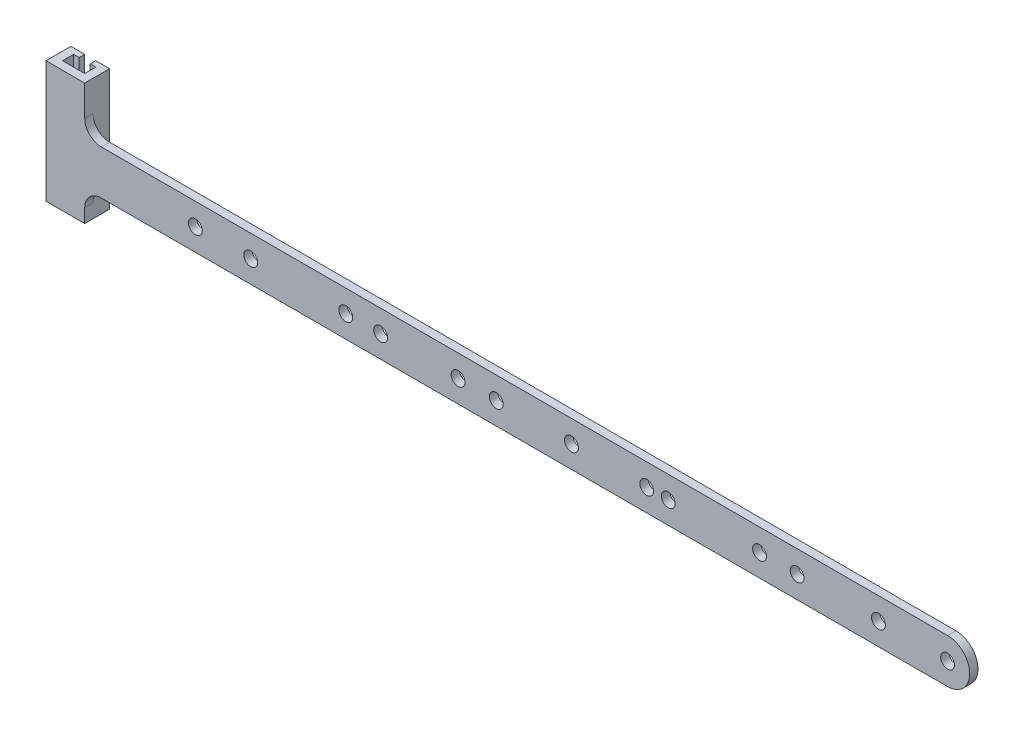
ISO-10303-21;
HEADER;
FILE_DESCRIPTION(('STEP AP214'),'2;1');
FILE_NAME('part.step','',(''),(''),'','','');
FILE_SCHEMA(('AUTOMOTIVE_DESIGN { 1 0 10303 214 1 1 1 1 }'));
ENDSEC;
DATA;
#1=APPLICATION_CONTEXT('core data for automotive mechanical design processes');
#2=APPLICATION_PROTOCOL_DEFINITION('international standard','automotive_design',2000,#1);
#3=PRODUCT_CONTEXT('',#1,'mechanical');
#4=PRODUCT('Part','Part','',(#3));
#5=PRODUCT_RELATED_PRODUCT_CATEGORY('part','',(#4));
#6=PRODUCT_DEFINITION_FORMATION('','',#4);
#7=PRODUCT_DEFINITION_CONTEXT('part definition',#1,'design');
#8=PRODUCT_DEFINITION('design','',#6,#7);
#9=PRODUCT_DEFINITION_SHAPE('','',#8);
#10=(LENGTH_UNIT() NAMED_UNIT(*) SI_UNIT(.MILLI.,.METRE.));
#11=(NAMED_UNIT(*) PLANE_ANGLE_UNIT() SI_UNIT($,.RADIAN.));
#12=(NAMED_UNIT(*) SI_UNIT($,.STERADIAN.) SOLID_ANGLE_UNIT());
#13=UNCERTAINTY_MEASURE_WITH_UNIT(LENGTH_MEASURE(1.E-05),#10,'distance_accuracy_value','');
#14=(GEOMETRIC_REPRESENTATION_CONTEXT(3) GLOBAL_UNCERTAINTY_ASSIGNED_CONTEXT((#13)) GLOBAL_UNIT_ASSIGNED_CONTEXT((#10,
#11,#12)) REPRESENTATION_CONTEXT('',''));
#15=CARTESIAN_POINT('',(0.,0.,0.));
#16=DIRECTION('',(0.,0.,1.));
#17=DIRECTION('',(1.,0.,0.));
#18=AXIS2_PLACEMENT_3D('',#15,#16,#17);
#19=CARTESIAN_POINT('',(-11.6861635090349,-30.1146991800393,0.));
#20=DIRECTION('',(0.,0.,-1.));
#21=DIRECTION('',(-1.,0.,0.));
#22=AXIS2_PLACEMENT_3D('',#19,#20,#21);
#23=PLANE('',#22);
#24=CARTESIAN_POINT('',(269.313836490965,-44.1146991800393,0.));
#25=DIRECTION('',(0.,0.,-1.));
#26=DIRECTION('',(-1.,0.,0.));
#27=AXIS2_PLACEMENT_3D('',#24,#25,#26);
#28=CIRCLE('',#27,2.50000000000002);
#29=CARTESIAN_POINT('',(266.813836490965,-44.1146991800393,0.));
#30=VERTEX_POINT('',#29);
#31=EDGE_CURVE('E591',#30,#30,#28,.T.);
#32=ORIENTED_EDGE('',*,*,#31,.F.);
#33=EDGE_LOOP('',(#32));
#34=FACE_BOUND('',#33,.T.);
#35=CARTESIAN_POINT('',(185.513836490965,-44.1146991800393,0.));
#36=DIRECTION('',(0.,0.,-1.));
#37=DIRECTION('',(-1.,0.,0.));
#38=AXIS2_PLACEMENT_3D('',#35,#36,#37);
#39=CIRCLE('',#38,2.5);
#40=CARTESIAN_POINT('',(183.013836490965,-44.1146991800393,0.));
#41=VERTEX_POINT('',#40);
#42=EDGE_CURVE('E601',#41,#41,#39,.T.);
#43=ORIENTED_EDGE('',*,*,#42,.F.);
#44=EDGE_LOOP('',(#43));
#45=FACE_BOUND('',#44,.T.);
#46=CARTESIAN_POINT('',(294.313836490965,-44.1146991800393,0.));
#47=DIRECTION('',(0.,0.,-1.));
#48=DIRECTION('',(-1.,0.,0.));
#49=AXIS2_PLACEMENT_3D('',#46,#47,#48);
#50=CIRCLE('',#49,2.50000000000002);
#51=CARTESIAN_POINT('',(291.813836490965,-44.1146991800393,0.));
#52=VERTEX_POINT('',#51);
#53=EDGE_CURVE('E607',#52,#52,#50,.T.);
#54=ORIENTED_EDGE('',*,*,#53,.F.);
#55=EDGE_LOOP('',(#54));
#56=FACE_BOUND('',#55,.T.);
#57=CARTESIAN_POINT('',(89.3138364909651,-44.1146991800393,0.));
#58=DIRECTION('',(0.,0.,-1.));
#59=DIRECTION('',(-1.,0.,0.));
#60=AXIS2_PLACEMENT_3D('',#57,#58,#59);
#61=CIRCLE('',#60,2.5);
#62=CARTESIAN_POINT('',(86.8138364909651,-44.1146991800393,0.));
#63=VERTEX_POINT('',#62);
#64=EDGE_CURVE('E613',#63,#63,#61,.T.);
#65=ORIENTED_EDGE('',*,*,#64,.F.);
#66=EDGE_LOOP('',(#65));
#67=FACE_BOUND('',#66,.T.);
#68=CARTESIAN_POINT('',(158.313836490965,-44.1146991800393,0.));
#69=DIRECTION('',(0.,0.,-1.));
#70=DIRECTION('',(-1.,0.,0.));
#71=AXIS2_PLACEMENT_3D('',#68,#69,#70);
#72=CIRCLE('',#71,2.5);
#73=CARTESIAN_POINT('',(155.813836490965,-44.1146991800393,0.));
#74=VERTEX_POINT('',#73);
#75=EDGE_CURVE('E619',#74,#74,#72,.T.);
#76=ORIENTED_EDGE('',*,*,#75,.F.);
#77=EDGE_LOOP('',(#76));
#78=FACE_BOUND('',#77,.T.);
#79=CARTESIAN_POINT('',(117.313836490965,-44.1146991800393,0.));
#80=DIRECTION('',(0.,0.,-1.));
#81=DIRECTION('',(-1.,0.,0.));
#82=AXIS2_PLACEMENT_3D('',#79,#80,#81);
#83=CIRCLE('',#82,2.5);
#84=CARTESIAN_POINT('',(114.813836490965,-44.1146991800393,0.));
#85=VERTEX_POINT('',#84);
#86=EDGE_CURVE('E625',#85,#85,#83,.T.);
#87=ORIENTED_EDGE('',*,*,#86,.F.);
#88=EDGE_LOOP('',(#87));
#89=FACE_BOUND('',#88,.T.);
#90=CARTESIAN_POINT('',(239.913836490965,-44.1146991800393,0.));
#91=DIRECTION('',(0.,0.,-1.));
#92=DIRECTION('',(-1.,0.,0.));
#93=AXIS2_PLACEMENT_3D('',#90,#91,#92);
#94=CIRCLE('',#93,2.5);
#95=CARTESIAN_POINT('',(237.413836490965,-44.1146991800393,0.));
#96=VERTEX_POINT('',#95);
#97=EDGE_CURVE('E631',#96,#96,#94,.T.);
#98=ORIENTED_EDGE('',*,*,#97,.F.);
#99=EDGE_LOOP('',(#98));
#100=FACE_BOUND('',#99,.T.);
#101=CARTESIAN_POINT('',(226.313836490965,-44.1146991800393,0.));
#102=DIRECTION('',(0.,0.,-1.));
#103=DIRECTION('',(-1.,0.,0.));
#104=AXIS2_PLACEMENT_3D('',#101,#102,#103);
#105=CIRCLE('',#104,2.5);
#106=CARTESIAN_POINT('',(223.813836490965,-44.1146991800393,0.));
#107=VERTEX_POINT('',#106);
#108=EDGE_CURVE('E637',#107,#107,#105,.T.);
#109=ORIENTED_EDGE('',*,*,#108,.F.);
#110=EDGE_LOOP('',(#109));
#111=FACE_BOUND('',#110,.T.);
#112=CARTESIAN_POINT('',(193.313836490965,-44.1146991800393,0.));
#113=DIRECTION('',(0.,0.,-1.));
#114=DIRECTION('',(-1.,0.,0.));
#115=AXIS2_PLACEMENT_3D('',#112,#113,#114);
#116=CIRCLE('',#115,2.5);
#117=CARTESIAN_POINT('',(190.813836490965,-44.1146991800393,0.));
#118=VERTEX_POINT('',#117);
#119=EDGE_CURVE('E643',#118,#118,#116,.T.);
#120=ORIENTED_EDGE('',*,*,#119,.F.);
#121=EDGE_LOOP('',(#120));
#122=FACE_BOUND('',#121,.T.);
#123=CARTESIAN_POINT('',(131.113836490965,-44.1146991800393,0.));
#124=DIRECTION('',(0.,0.,-1.));
#125=DIRECTION('',(-1.,0.,0.));
#126=AXIS2_PLACEMENT_3D('',#123,#124,#125);
#127=CIRCLE('',#126,2.5);
#128=CARTESIAN_POINT('',(128.613836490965,-44.1146991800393,0.));
#129=VERTEX_POINT('',#128);
#130=EDGE_CURVE('E649',#129,#129,#127,.T.);
#131=ORIENTED_EDGE('',*,*,#130,.F.);
#132=EDGE_LOOP('',(#131));
#133=FACE_BOUND('',#132,.T.);
#134=CARTESIAN_POINT('',(76.7138364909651,-44.1146991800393,0.));
#135=DIRECTION('',(0.,0.,-1.));
#136=DIRECTION('',(-1.,0.,0.));
#137=AXIS2_PLACEMENT_3D('',#134,#135,#136);
#138=CIRCLE('',#137,2.5);
#139=CARTESIAN_POINT('',(74.2138364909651,-44.1146991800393,0.));
#140=VERTEX_POINT('',#139);
#141=EDGE_CURVE('E655',#140,#140,#138,.T.);
#142=ORIENTED_EDGE('',*,*,#141,.F.);
#143=EDGE_LOOP('',(#142));
#144=FACE_BOUND('',#143,.T.);
#145=CARTESIAN_POINT('',(42.3138364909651,-44.1146991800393,0.));
#146=DIRECTION('',(0.,0.,-1.));
#147=DIRECTION('',(-1.,0.,0.));
#148=AXIS2_PLACEMENT_3D('',#145,#146,#147);
#149=CIRCLE('',#148,2.5);
#150=CARTESIAN_POINT('',(39.8138364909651,-44.1146991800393,0.));
#151=VERTEX_POINT('',#150);
#152=EDGE_CURVE('E661',#151,#151,#149,.T.);
#153=ORIENTED_EDGE('',*,*,#152,.F.);
#154=EDGE_LOOP('',(#153));
#155=FACE_BOUND('',#154,.T.);
#156=CARTESIAN_POINT('',(22.3138364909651,-44.1146991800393,0.));
#157=DIRECTION('',(0.,0.,-1.));
#158=DIRECTION('',(-1.,0.,0.));
#159=AXIS2_PLACEMENT_3D('',#156,#157,#158);
#160=CIRCLE('',#159,2.5);
#161=CARTESIAN_POINT('',(19.8138364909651,-44.1146991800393,0.));
#162=VERTEX_POINT('',#161);
#163=EDGE_CURVE('E667',#162,#162,#160,.T.);
#164=ORIENTED_EDGE('',*,*,#163,.F.);
#165=EDGE_LOOP('',(#164));
#166=FACE_BOUND('',#165,.T.);
#167=DIRECTION('',(0.,1.,0.));
#168=VECTOR('',#167,1.);
#169=CARTESIAN_POINT('',(-17.6861635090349,-63.1146991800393,0.));
#170=LINE('',#169,#168);
#171=CARTESIAN_POINT('',(-17.6861635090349,-58.1146991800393,0.));
#172=VERTEX_POINT('',#171);
#173=CARTESIAN_POINT('',(-17.6861635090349,-30.1146991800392,0.));
#174=VERTEX_POINT('',#173);
#175=EDGE_CURVE('E147',#172,#174,#170,.T.);
#176=ORIENTED_EDGE('',*,*,#175,.T.);
#177=CARTESIAN_POINT('',(-11.6861635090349,-30.1146991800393,0.));
#178=DIRECTION('',(0.,0.,-1.));
#179=DIRECTION('',(-1.,0.,0.));
#180=AXIS2_PLACEMENT_3D('',#177,#178,#179);
#181=CIRCLE('',#180,6.);
#182=CARTESIAN_POINT('',(-11.6861635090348,-36.1146991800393,0.));
#183=VERTEX_POINT('',#182);
#184=EDGE_CURVE('E163',#183,#174,#181,.T.);
#185=ORIENTED_EDGE('',*,*,#184,.F.);
#186=DIRECTION('',(-1.,0.,0.));
#187=VECTOR('',#186,1.);
#188=CARTESIAN_POINT('',(-11.6861635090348,-36.1146991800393,0.));
#189=LINE('',#188,#187);
#190=CARTESIAN_POINT('',(294.313836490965,-36.1146991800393,0.));
#191=VERTEX_POINT('',#190);
#192=EDGE_CURVE('E80',#191,#183,#189,.T.);
#193=ORIENTED_EDGE('',*,*,#192,.F.);
#194=CARTESIAN_POINT('',(294.313836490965,-44.1146991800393,0.));
#195=DIRECTION('',(0.,0.,1.));
#196=DIRECTION('',(-1.,0.,0.));
#197=AXIS2_PLACEMENT_3D('',#194,#195,#196);
#198=CIRCLE('',#197,8.);
#199=CARTESIAN_POINT('',(294.313836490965,-52.1146991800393,0.));
#200=VERTEX_POINT('',#199);
#201=EDGE_CURVE('E188',#200,#191,#198,.T.);
#202=ORIENTED_EDGE('',*,*,#201,.F.);
#203=DIRECTION('',(1.,0.,0.));
#204=VECTOR('',#203,1.);
#205=CARTESIAN_POINT('',(-11.6861635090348,-52.1146991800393,0.));
#206=LINE('',#205,#204);
#207=CARTESIAN_POINT('',(-11.6861635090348,-52.1146991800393,0.));
#208=VERTEX_POINT('',#207);
#209=EDGE_CURVE('E182',#208,#200,#206,.T.);
#210=ORIENTED_EDGE('',*,*,#209,.F.);
#211=CARTESIAN_POINT('',(-11.6861635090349,-58.1146991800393,0.));
#212=DIRECTION('',(0.,0.,-1.));
#213=DIRECTION('',(-1.,0.,0.));
#214=AXIS2_PLACEMENT_3D('',#211,#212,#213);
#215=CIRCLE('',#214,6.);
#216=EDGE_CURVE('E137',#172,#208,#215,.T.);
#217=ORIENTED_EDGE('',*,*,#216,.F.);
#218=EDGE_LOOP('',(#176,#185,#193,#202,#210,#217));
#219=FACE_BOUND('',#218,.T.);
#220=ADVANCED_FACE('F32',(#34,#45,#56,#67,#78,#89,#100,#111,#122,#133,#144,#155,#166,#219),#23,.T.);
#221=DIRECTION('',(0.,1.,0.));
#222=VECTOR('',#221,1.);
#223=CARTESIAN_POINT('',(-20.6861635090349,-63.1146991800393,0.));
#224=LINE('',#223,#222);
#225=CARTESIAN_POINT('',(-20.6861635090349,-63.1146991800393,0.));
#226=VERTEX_POINT('',#225);
#227=CARTESIAN_POINT('',(-20.6861635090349,-19.1146991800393,0.));
#228=VERTEX_POINT('',#227);
#229=EDGE_CURVE('E695',#226,#228,#224,.T.);
#230=ORIENTED_EDGE('',*,*,#229,.F.);
#231=DIRECTION('',(1.,0.,0.));
#232=VECTOR('',#231,1.);
#233=CARTESIAN_POINT('',(-31.6861635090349,-63.1146991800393,0.));
#234=LINE('',#233,#232);
#235=CARTESIAN_POINT('',(-28.6861635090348,-63.1146991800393,0.));
#236=VERTEX_POINT('',#235);
#237=EDGE_CURVE('E140',#236,#226,#234,.T.);
#238=ORIENTED_EDGE('',*,*,#237,.F.);
#239=DIRECTION('',(0.,1.,0.));
#240=VECTOR('',#239,1.);
#241=CARTESIAN_POINT('',(-28.6861635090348,-63.1146991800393,0.));
#242=LINE('',#241,#240);
#243=CARTESIAN_POINT('',(-28.6861635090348,-19.1146991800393,0.));
#244=VERTEX_POINT('',#243);
#245=EDGE_CURVE('E150',#236,#244,#242,.T.);
#246=ORIENTED_EDGE('',*,*,#245,.T.);
#247=DIRECTION('',(-1.,0.,0.));
#248=VECTOR('',#247,1.);
#249=CARTESIAN_POINT('',(-31.6861635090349,-19.1146991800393,0.));
#250=LINE('',#249,#248);
#251=EDGE_CURVE('E36',#228,#244,#250,.T.);
#252=ORIENTED_EDGE('',*,*,#251,.F.);
#253=EDGE_LOOP('',(#230,#238,#246,#252));
#254=FACE_BOUND('',#253,.T.);
#255=ADVANCED_FACE('F262',(#254),#23,.T.);
#256=CARTESIAN_POINT('',(-31.6861635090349,-19.1146991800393,2.99999999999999));
#257=DIRECTION('',(0.,-1.,0.));
#258=DIRECTION('',(1.,0.,0.));
#259=AXIS2_PLACEMENT_3D('',#256,#257,#258);
#260=PLANE('',#259);
#261=DIRECTION('',(0.,0.,-1.));
#262=VECTOR('',#261,1.);
#263=CARTESIAN_POINT('',(-17.6861635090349,-19.1146991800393,2.99999999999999));
#264=LINE('',#263,#262);
#265=CARTESIAN_POINT('',(-17.6861635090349,-19.1146991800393,2.99999999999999));
#266=VERTEX_POINT('',#265);
#267=CARTESIAN_POINT('',(-17.6861635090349,-19.1146991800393,-6.));
#268=VERTEX_POINT('',#267);
#269=EDGE_CURVE('E130',#266,#268,#264,.T.);
#270=ORIENTED_EDGE('',*,*,#269,.T.);
#271=DIRECTION('',(-1.,0.,0.));
#272=VECTOR('',#271,1.);
#273=CARTESIAN_POINT('',(-17.6861635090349,-19.1146991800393,-6.));
#274=LINE('',#273,#272);
#275=CARTESIAN_POINT('',(-22.6861635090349,-19.1146991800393,-6.));
#276=VERTEX_POINT('',#275);
#277=EDGE_CURVE('E670',#268,#276,#274,.T.);
#278=ORIENTED_EDGE('',*,*,#277,.T.);
#279=DIRECTION('',(0.,0.,1.));
#280=VECTOR('',#279,1.);
#281=CARTESIAN_POINT('',(-22.6861635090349,-19.1146991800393,-6.));
#282=LINE('',#281,#280);
#283=CARTESIAN_POINT('',(-22.6861635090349,-19.1146991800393,-4.));
#284=VERTEX_POINT('',#283);
#285=EDGE_CURVE('E686',#276,#284,#282,.T.);
#286=ORIENTED_EDGE('',*,*,#285,.T.);
#287=DIRECTION('',(1.,0.,0.));
#288=VECTOR('',#287,1.);
#289=CARTESIAN_POINT('',(-20.6861635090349,-19.1146991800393,-4.));
#290=LINE('',#289,#288);
#291=CARTESIAN_POINT('',(-20.6861635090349,-19.1146991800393,-4.));
#292=VERTEX_POINT('',#291);
#293=EDGE_CURVE('E689',#284,#292,#290,.T.);
#294=ORIENTED_EDGE('',*,*,#293,.T.);
#295=DIRECTION('',(0.,0.,1.));
#296=VECTOR('',#295,1.);
#297=CARTESIAN_POINT('',(-20.6861635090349,-19.1146991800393,0.));
#298=LINE('',#297,#296);
#299=EDGE_CURVE('E675',#292,#228,#298,.T.);
#300=ORIENTED_EDGE('',*,*,#299,.T.);
#301=ORIENTED_EDGE('',*,*,#251,.T.);
#302=DIRECTION('',(0.,0.,-1.));
#303=VECTOR('',#302,1.);
#304=CARTESIAN_POINT('',(-28.6861635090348,-19.1146991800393,0.));
#305=LINE('',#304,#303);
#306=CARTESIAN_POINT('',(-28.6861635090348,-19.1146991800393,-4.));
#307=VERTEX_POINT('',#306);
#308=EDGE_CURVE('E144',#244,#307,#305,.T.);
#309=ORIENTED_EDGE('',*,*,#308,.T.);
#310=DIRECTION('',(1.,0.,0.));
#311=VECTOR('',#310,1.);
#312=CARTESIAN_POINT('',(-28.6861635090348,-19.1146991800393,-4.));
#313=LINE('',#312,#311);
#314=CARTESIAN_POINT('',(-26.6861635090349,-19.1146991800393,-4.));
#315=VERTEX_POINT('',#314);
#316=EDGE_CURVE('E146',#307,#315,#313,.T.);
#317=ORIENTED_EDGE('',*,*,#316,.T.);
#318=DIRECTION('',(0.,0.,-1.));
#319=VECTOR('',#318,1.);
#320=CARTESIAN_POINT('',(-26.6861635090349,-19.1146991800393,-6.));
#321=LINE('',#320,#319);
#322=CARTESIAN_POINT('',(-26.6861635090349,-19.1146991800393,-6.));
#323=VERTEX_POINT('',#322);
#324=EDGE_CURVE('E230',#315,#323,#321,.T.);
#325=ORIENTED_EDGE('',*,*,#324,.T.);
#326=DIRECTION('',(-1.,0.,0.));
#327=VECTOR('',#326,1.);
#328=CARTESIAN_POINT('',(-31.6861635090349,-19.1146991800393,-6.));
#329=LINE('',#328,#327);
#330=CARTESIAN_POINT('',(-31.6861635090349,-19.1146991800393,-6.));
#331=VERTEX_POINT('',#330);
#332=EDGE_CURVE('E233',#323,#331,#329,.T.);
#333=ORIENTED_EDGE('',*,*,#332,.T.);
#334=DIRECTION('',(0.,0.,-1.));
#335=VECTOR('',#334,1.);
#336=CARTESIAN_POINT('',(-31.6861635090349,-19.1146991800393,2.99999999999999));
#337=LINE('',#336,#335);
#338=CARTESIAN_POINT('',(-31.6861635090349,-19.1146991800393,2.99999999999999));
#339=VERTEX_POINT('',#338);
#340=EDGE_CURVE('E11',#339,#331,#337,.T.);
#341=ORIENTED_EDGE('',*,*,#340,.F.);
#342=DIRECTION('',(-1.,0.,0.));
#343=VECTOR('',#342,1.);
#344=CARTESIAN_POINT('',(-31.6861635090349,-19.1146991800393,2.99999999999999));
#345=LINE('',#344,#343);
#346=EDGE_CURVE('E161',#266,#339,#345,.T.);
#347=ORIENTED_EDGE('',*,*,#346,.F.);
#348=EDGE_LOOP('',(#270,#278,#286,#294,#300,#301,#309,#317,#325,#333,#341,#347));
#349=FACE_BOUND('',#348,.T.);
#350=ADVANCED_FACE('F34',(#349),#260,.F.);
#351=CARTESIAN_POINT('',(-31.6861635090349,-19.1146991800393,2.99999999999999));
#352=DIRECTION('',(1.,0.,0.));
#353=DIRECTION('',(0.,1.,0.));
#354=AXIS2_PLACEMENT_3D('',#351,#352,#353);
#355=PLANE('',#354);
#356=ORIENTED_EDGE('',*,*,#340,.T.);
#357=DIRECTION('',(0.,1.,0.));
#358=VECTOR('',#357,1.);
#359=CARTESIAN_POINT('',(-31.6861635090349,-63.1146991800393,-6.));
#360=LINE('',#359,#358);
#361=CARTESIAN_POINT('',(-31.6861635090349,-63.1146991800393,-6.));
#362=VERTEX_POINT('',#361);
#363=EDGE_CURVE('E210',#362,#331,#360,.T.);
#364=ORIENTED_EDGE('',*,*,#363,.F.);
#365=DIRECTION('',(0.,0.,-1.));
#366=VECTOR('',#365,1.);
#367=CARTESIAN_POINT('',(-31.6861635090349,-63.1146991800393,2.99999999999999));
#368=LINE('',#367,#366);
#369=CARTESIAN_POINT('',(-31.6861635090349,-63.1146991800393,2.99999999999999));
#370=VERTEX_POINT('',#369);
#371=EDGE_CURVE('E42',#370,#362,#368,.T.);
#372=ORIENTED_EDGE('',*,*,#371,.F.);
#373=DIRECTION('',(0.,-1.,0.));
#374=VECTOR('',#373,1.);
#375=CARTESIAN_POINT('',(-31.6861635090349,-19.1146991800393,2.99999999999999));
#376=LINE('',#375,#374);
#377=EDGE_CURVE('E88',#339,#370,#376,.T.);
#378=ORIENTED_EDGE('',*,*,#377,.F.);
#379=EDGE_LOOP('',(#356,#364,#372,#378));
#380=FACE_BOUND('',#379,.T.);
#381=ADVANCED_FACE('F211',(#380),#355,.F.);
#382=CARTESIAN_POINT('',(-31.6861635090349,-63.1146991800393,2.99999999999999));
#383=DIRECTION('',(0.,1.,0.));
#384=DIRECTION('',(0.,0.,1.));
#385=AXIS2_PLACEMENT_3D('',#382,#383,#384);
#386=PLANE('',#385);
#387=ORIENTED_EDGE('',*,*,#371,.T.);
#388=DIRECTION('',(-1.,0.,0.));
#389=VECTOR('',#388,1.);
#390=CARTESIAN_POINT('',(-31.6861635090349,-63.1146991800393,-6.));
#391=LINE('',#390,#389);
#392=CARTESIAN_POINT('',(-26.6861635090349,-63.1146991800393,-6.));
#393=VERTEX_POINT('',#392);
#394=EDGE_CURVE('E155',#393,#362,#391,.T.);
#395=ORIENTED_EDGE('',*,*,#394,.F.);
#396=DIRECTION('',(0.,0.,-1.));
#397=VECTOR('',#396,1.);
#398=CARTESIAN_POINT('',(-26.6861635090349,-63.1146991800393,-6.));
#399=LINE('',#398,#397);
#400=CARTESIAN_POINT('',(-26.6861635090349,-63.1146991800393,-4.));
#401=VERTEX_POINT('',#400);
#402=EDGE_CURVE('E222',#401,#393,#399,.T.);
#403=ORIENTED_EDGE('',*,*,#402,.F.);
#404=DIRECTION('',(1.,0.,0.));
#405=VECTOR('',#404,1.);
#406=CARTESIAN_POINT('',(-28.6861635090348,-63.1146991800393,-4.));
#407=LINE('',#406,#405);
#408=CARTESIAN_POINT('',(-28.6861635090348,-63.1146991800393,-4.));
#409=VERTEX_POINT('',#408);
#410=EDGE_CURVE('E224',#409,#401,#407,.T.);
#411=ORIENTED_EDGE('',*,*,#410,.F.);
#412=DIRECTION('',(0.,0.,-1.));
#413=VECTOR('',#412,1.);
#414=CARTESIAN_POINT('',(-28.6861635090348,-63.1146991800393,0.));
#415=LINE('',#414,#413);
#416=EDGE_CURVE('E156',#236,#409,#415,.T.);
#417=ORIENTED_EDGE('',*,*,#416,.F.);
#418=ORIENTED_EDGE('',*,*,#237,.T.);
#419=DIRECTION('',(0.,0.,1.));
#420=VECTOR('',#419,1.);
#421=CARTESIAN_POINT('',(-20.6861635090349,-63.1146991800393,0.));
#422=LINE('',#421,#420);
#423=CARTESIAN_POINT('',(-20.6861635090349,-63.1146991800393,-4.));
#424=VERTEX_POINT('',#423);
#425=EDGE_CURVE('E681',#424,#226,#422,.T.);
#426=ORIENTED_EDGE('',*,*,#425,.F.);
#427=DIRECTION('',(1.,0.,0.));
#428=VECTOR('',#427,1.);
#429=CARTESIAN_POINT('',(-20.6861635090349,-63.1146991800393,-4.));
#430=LINE('',#429,#428);
#431=CARTESIAN_POINT('',(-22.6861635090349,-63.1146991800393,-4.));
#432=VERTEX_POINT('',#431);
#433=EDGE_CURVE('E678',#432,#424,#430,.T.);
#434=ORIENTED_EDGE('',*,*,#433,.F.);
#435=DIRECTION('',(0.,0.,1.));
#436=VECTOR('',#435,1.);
#437=CARTESIAN_POINT('',(-22.6861635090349,-63.1146991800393,-6.));
#438=LINE('',#437,#436);
#439=CARTESIAN_POINT('',(-22.6861635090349,-63.1146991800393,-6.));
#440=VERTEX_POINT('',#439);
#441=EDGE_CURVE('E674',#440,#432,#438,.T.);
#442=ORIENTED_EDGE('',*,*,#441,.F.);
#443=DIRECTION('',(-1.,0.,0.));
#444=VECTOR('',#443,1.);
#445=CARTESIAN_POINT('',(-17.6861635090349,-63.1146991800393,-6.));
#446=LINE('',#445,#444);
#447=CARTESIAN_POINT('',(-17.6861635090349,-63.1146991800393,-6.));
#448=VERTEX_POINT('',#447);
#449=EDGE_CURVE('E671',#448,#440,#446,.T.);
#450=ORIENTED_EDGE('',*,*,#449,.F.);
#451=DIRECTION('',(0.,0.,-1.));
#452=VECTOR('',#451,1.);
#453=CARTESIAN_POINT('',(-17.6861635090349,-63.1146991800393,2.99999999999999));
#454=LINE('',#453,#452);
#455=CARTESIAN_POINT('',(-17.6861635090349,-63.1146991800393,2.99999999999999));
#456=VERTEX_POINT('',#455);
#457=EDGE_CURVE('E196',#456,#448,#454,.T.);
#458=ORIENTED_EDGE('',*,*,#457,.F.);
#459=DIRECTION('',(1.,0.,0.));
#460=VECTOR('',#459,1.);
#461=CARTESIAN_POINT('',(-31.6861635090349,-63.1146991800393,2.99999999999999));
#462=LINE('',#461,#460);
#463=EDGE_CURVE('E165',#370,#456,#462,.T.);
#464=ORIENTED_EDGE('',*,*,#463,.F.);
#465=EDGE_LOOP('',(#387,#395,#403,#411,#417,#418,#426,#434,#442,#450,#458,#464));
#466=FACE_BOUND('',#465,.T.);
#467=ADVANCED_FACE('F203',(#466),#386,.F.);
#468=CARTESIAN_POINT('',(-11.6861635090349,-58.1146991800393,2.99999999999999));
#469=DIRECTION('',(0.,0.,-1.));
#470=DIRECTION('',(-1.,0.,0.));
#471=AXIS2_PLACEMENT_3D('',#468,#469,#470);
#472=CYLINDRICAL_SURFACE('',#471,6.);
#473=ORIENTED_EDGE('',*,*,#216,.T.);
#474=DIRECTION('',(0.,0.,-1.));
#475=VECTOR('',#474,1.);
#476=CARTESIAN_POINT('',(-11.6861635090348,-52.1146991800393,2.99999999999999));
#477=LINE('',#476,#475);
#478=CARTESIAN_POINT('',(-11.6861635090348,-52.1146991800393,2.99999999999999));
#479=VERTEX_POINT('',#478);
#480=EDGE_CURVE('E185',#479,#208,#477,.T.);
#481=ORIENTED_EDGE('',*,*,#480,.F.);
#482=CARTESIAN_POINT('',(-11.6861635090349,-58.1146991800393,2.99999999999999));
#483=DIRECTION('',(0.,0.,-1.));
#484=DIRECTION('',(-1.,0.,0.));
#485=AXIS2_PLACEMENT_3D('',#482,#483,#484);
#486=CIRCLE('',#485,6.);
#487=CARTESIAN_POINT('',(-17.6861635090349,-58.1146991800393,2.99999999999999));
#488=VERTEX_POINT('',#487);
#489=EDGE_CURVE('E169',#488,#479,#486,.T.);
#490=ORIENTED_EDGE('',*,*,#489,.F.);
#491=DIRECTION('',(0.,0.,-1.));
#492=VECTOR('',#491,1.);
#493=CARTESIAN_POINT('',(-17.6861635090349,-58.1146991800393,2.99999999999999));
#494=LINE('',#493,#492);
#495=EDGE_CURVE('E193',#488,#172,#494,.T.);
#496=ORIENTED_EDGE('',*,*,#495,.T.);
#497=EDGE_LOOP('',(#473,#481,#490,#496));
#498=FACE_BOUND('',#497,.T.);
#499=ADVANCED_FACE('F290',(#498),#472,.F.);
#500=CARTESIAN_POINT('',(-11.6861635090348,-52.1146991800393,2.99999999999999));
#501=DIRECTION('',(0.,1.,0.));
#502=DIRECTION('',(0.,0.,1.));
#503=AXIS2_PLACEMENT_3D('',#500,#501,#502);
#504=PLANE('',#503);
#505=ORIENTED_EDGE('',*,*,#209,.T.);
#506=DIRECTION('',(0.,0.,-1.));
#507=VECTOR('',#506,1.);
#508=CARTESIAN_POINT('',(294.313836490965,-52.1146991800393,2.99999999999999));
#509=LINE('',#508,#507);
#510=CARTESIAN_POINT('',(294.313836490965,-52.1146991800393,2.99999999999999));
#511=VERTEX_POINT('',#510);
#512=EDGE_CURVE('E179',#511,#200,#509,.T.);
#513=ORIENTED_EDGE('',*,*,#512,.F.);
#514=DIRECTION('',(1.,0.,0.));
#515=VECTOR('',#514,1.);
#516=CARTESIAN_POINT('',(-11.6861635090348,-52.1146991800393,2.99999999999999));
#517=LINE('',#516,#515);
#518=EDGE_CURVE('E171',#479,#511,#517,.T.);
#519=ORIENTED_EDGE('',*,*,#518,.F.);
#520=ORIENTED_EDGE('',*,*,#480,.T.);
#521=EDGE_LOOP('',(#505,#513,#519,#520));
#522=FACE_BOUND('',#521,.T.);
#523=ADVANCED_FACE('F180',(#522),#504,.F.);
#524=CARTESIAN_POINT('',(294.313836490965,-44.1146991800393,2.99999999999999));
#525=DIRECTION('',(0.,0.,-1.));
#526=DIRECTION('',(-1.,0.,0.));
#527=AXIS2_PLACEMENT_3D('',#524,#525,#526);
#528=CYLINDRICAL_SURFACE('',#527,8.);
#529=ORIENTED_EDGE('',*,*,#201,.T.);
#530=DIRECTION('',(0.,0.,-1.));
#531=VECTOR('',#530,1.);
#532=CARTESIAN_POINT('',(294.313836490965,-36.1146991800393,2.99999999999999));
#533=LINE('',#532,#531);
#534=CARTESIAN_POINT('',(294.313836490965,-36.1146991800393,2.99999999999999));
#535=VERTEX_POINT('',#534);
#536=EDGE_CURVE('E124',#535,#191,#533,.T.);
#537=ORIENTED_EDGE('',*,*,#536,.F.);
#538=CARTESIAN_POINT('',(294.313836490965,-44.1146991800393,2.99999999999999));
#539=DIRECTION('',(0.,0.,1.));
#540=DIRECTION('',(-1.,0.,0.));
#541=AXIS2_PLACEMENT_3D('',#538,#539,#540);
#542=CIRCLE('',#541,8.);
#543=EDGE_CURVE('E116',#511,#535,#542,.T.);
#544=ORIENTED_EDGE('',*,*,#543,.F.);
#545=ORIENTED_EDGE('',*,*,#512,.T.);
#546=EDGE_LOOP('',(#529,#537,#544,#545));
#547=FACE_BOUND('',#546,.T.);
#548=ADVANCED_FACE('F187',(#547),#528,.T.);
#549=CARTESIAN_POINT('',(-11.6861635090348,-36.1146991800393,2.99999999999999));
#550=DIRECTION('',(0.,-1.,0.));
#551=DIRECTION('',(0.,0.,-1.));
#552=AXIS2_PLACEMENT_3D('',#549,#550,#551);
#553=PLANE('',#552);
#554=ORIENTED_EDGE('',*,*,#192,.T.);
#555=DIRECTION('',(0.,0.,-1.));
#556=VECTOR('',#555,1.);
#557=CARTESIAN_POINT('',(-11.6861635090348,-36.1146991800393,2.99999999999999));
#558=LINE('',#557,#556);
#559=CARTESIAN_POINT('',(-11.6861635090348,-36.1146991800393,2.99999999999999));
#560=VERTEX_POINT('',#559);
#561=EDGE_CURVE('E119',#560,#183,#558,.T.);
#562=ORIENTED_EDGE('',*,*,#561,.F.);
#563=DIRECTION('',(-1.,0.,0.));
#564=VECTOR('',#563,1.);
#565=CARTESIAN_POINT('',(-11.6861635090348,-36.1146991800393,2.99999999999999));
#566=LINE('',#565,#564);
#567=EDGE_CURVE('E110',#535,#560,#566,.T.);
#568=ORIENTED_EDGE('',*,*,#567,.F.);
#569=ORIENTED_EDGE('',*,*,#536,.T.);
#570=EDGE_LOOP('',(#554,#562,#568,#569));
#571=FACE_BOUND('',#570,.T.);
#572=ADVANCED_FACE('F120',(#571),#553,.F.);
#573=CARTESIAN_POINT('',(-11.6861635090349,-30.1146991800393,2.99999999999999));
#574=DIRECTION('',(0.,0.,-1.));
#575=DIRECTION('',(-1.,0.,0.));
#576=AXIS2_PLACEMENT_3D('',#573,#574,#575);
#577=CYLINDRICAL_SURFACE('',#576,6.);
#578=ORIENTED_EDGE('',*,*,#184,.T.);
#579=DIRECTION('',(0.,0.,-1.));
#580=VECTOR('',#579,1.);
#581=CARTESIAN_POINT('',(-17.6861635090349,-30.1146991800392,2.99999999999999));
#582=LINE('',#581,#580);
#583=CARTESIAN_POINT('',(-17.6861635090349,-30.1146991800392,2.99999999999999));
#584=VERTEX_POINT('',#583);
#585=EDGE_CURVE('E125',#584,#174,#582,.T.);
#586=ORIENTED_EDGE('',*,*,#585,.F.);
#587=CARTESIAN_POINT('',(-11.6861635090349,-30.1146991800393,2.99999999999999));
#588=DIRECTION('',(0.,0.,-1.));
#589=DIRECTION('',(-1.,0.,0.));
#590=AXIS2_PLACEMENT_3D('',#587,#588,#589);
#591=CIRCLE('',#590,6.);
#592=EDGE_CURVE('E113',#560,#584,#591,.T.);
#593=ORIENTED_EDGE('',*,*,#592,.F.);
#594=ORIENTED_EDGE('',*,*,#561,.T.);
#595=EDGE_LOOP('',(#578,#586,#593,#594));
#596=FACE_BOUND('',#595,.T.);
#597=ADVANCED_FACE('F127',(#596),#577,.F.);
#598=CARTESIAN_POINT('',(-17.6861635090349,-19.1146991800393,2.99999999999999));
#599=DIRECTION('',(-1.,0.,0.));
#600=DIRECTION('',(0.,0.,1.));
#601=AXIS2_PLACEMENT_3D('',#598,#599,#600);
#602=PLANE('',#601);
#603=ORIENTED_EDGE('',*,*,#585,.T.);
#604=ORIENTED_EDGE('',*,*,#175,.F.);
#605=ORIENTED_EDGE('',*,*,#495,.F.);
#606=DIRECTION('',(0.,1.,0.));
#607=VECTOR('',#606,1.);
#608=CARTESIAN_POINT('',(-17.6861635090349,-63.1146991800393,2.99999999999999));
#609=LINE('',#608,#607);
#610=EDGE_CURVE('E167',#456,#488,#609,.T.);
#611=ORIENTED_EDGE('',*,*,#610,.F.);
#612=ORIENTED_EDGE('',*,*,#457,.T.);
#613=DIRECTION('',(0.,1.,0.));
#614=VECTOR('',#613,1.);
#615=CARTESIAN_POINT('',(-17.6861635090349,-63.1146991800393,-6.));
#616=LINE('',#615,#614);
#617=EDGE_CURVE('E684',#448,#268,#616,.T.);
#618=ORIENTED_EDGE('',*,*,#617,.T.);
#619=ORIENTED_EDGE('',*,*,#269,.F.);
#620=DIRECTION('',(0.,1.,0.));
#621=VECTOR('',#620,1.);
#622=CARTESIAN_POINT('',(-17.6861635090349,-19.1146991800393,2.99999999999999));
#623=LINE('',#622,#621);
#624=EDGE_CURVE('E58',#584,#266,#623,.T.);
#625=ORIENTED_EDGE('',*,*,#624,.F.);
#626=EDGE_LOOP('',(#603,#604,#605,#611,#612,#618,#619,#625));
#627=FACE_BOUND('',#626,.T.);
#628=ADVANCED_FACE('F278',(#627),#602,.F.);
#629=CARTESIAN_POINT('',(-11.6861635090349,-30.1146991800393,2.99999999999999));
#630=DIRECTION('',(0.,0.,-1.));
#631=DIRECTION('',(-1.,0.,0.));
#632=AXIS2_PLACEMENT_3D('',#629,#630,#631);
#633=PLANE('',#632);
#634=CARTESIAN_POINT('',(269.313836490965,-44.1146991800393,2.99999999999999));
#635=DIRECTION('',(0.,0.,1.));
#636=DIRECTION('',(1.,0.,0.));
#637=AXIS2_PLACEMENT_3D('',#634,#635,#636);
#638=CIRCLE('',#637,2.50000000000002);
#639=CARTESIAN_POINT('',(271.813836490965,-44.1146991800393,2.99999999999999));
#640=VERTEX_POINT('',#639);
#641=EDGE_CURVE('E594',#640,#640,#638,.T.);
#642=ORIENTED_EDGE('',*,*,#641,.F.);
#643=EDGE_LOOP('',(#642));
#644=FACE_BOUND('',#643,.T.);
#645=CARTESIAN_POINT('',(185.513836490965,-44.1146991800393,2.99999999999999));
#646=DIRECTION('',(0.,0.,1.));
#647=DIRECTION('',(1.,0.,0.));
#648=AXIS2_PLACEMENT_3D('',#645,#646,#647);
#649=CIRCLE('',#648,2.5);
#650=CARTESIAN_POINT('',(188.013836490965,-44.1146991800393,2.99999999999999));
#651=VERTEX_POINT('',#650);
#652=EDGE_CURVE('E596',#651,#651,#649,.T.);
#653=ORIENTED_EDGE('',*,*,#652,.F.);
#654=EDGE_LOOP('',(#653));
#655=FACE_BOUND('',#654,.T.);
#656=CARTESIAN_POINT('',(294.313836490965,-44.1146991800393,2.99999999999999));
#657=DIRECTION('',(0.,0.,1.));
#658=DIRECTION('',(1.,0.,0.));
#659=AXIS2_PLACEMENT_3D('',#656,#657,#658);
#660=CIRCLE('',#659,2.50000000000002);
#661=CARTESIAN_POINT('',(296.813836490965,-44.1146991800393,2.99999999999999));
#662=VERTEX_POINT('',#661);
#663=EDGE_CURVE('E604',#662,#662,#660,.T.);
#664=ORIENTED_EDGE('',*,*,#663,.F.);
#665=EDGE_LOOP('',(#664));
#666=FACE_BOUND('',#665,.T.);
#667=CARTESIAN_POINT('',(89.3138364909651,-44.1146991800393,2.99999999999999));
#668=DIRECTION('',(0.,0.,1.));
#669=DIRECTION('',(1.,0.,0.));
#670=AXIS2_PLACEMENT_3D('',#667,#668,#669);
#671=CIRCLE('',#670,2.5);
#672=CARTESIAN_POINT('',(91.8138364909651,-44.1146991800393,2.99999999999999));
#673=VERTEX_POINT('',#672);
#674=EDGE_CURVE('E610',#673,#673,#671,.T.);
#675=ORIENTED_EDGE('',*,*,#674,.F.);
#676=EDGE_LOOP('',(#675));
#677=FACE_BOUND('',#676,.T.);
#678=CARTESIAN_POINT('',(158.313836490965,-44.1146991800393,2.99999999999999));
#679=DIRECTION('',(0.,0.,1.));
#680=DIRECTION('',(1.,0.,0.));
#681=AXIS2_PLACEMENT_3D('',#678,#679,#680);
#682=CIRCLE('',#681,2.5);
#683=CARTESIAN_POINT('',(160.813836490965,-44.1146991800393,2.99999999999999));
#684=VERTEX_POINT('',#683);
#685=EDGE_CURVE('E616',#684,#684,#682,.T.);
#686=ORIENTED_EDGE('',*,*,#685,.F.);
#687=EDGE_LOOP('',(#686));
#688=FACE_BOUND('',#687,.T.);
#689=CARTESIAN_POINT('',(117.313836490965,-44.1146991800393,2.99999999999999));
#690=DIRECTION('',(0.,0.,1.));
#691=DIRECTION('',(1.,0.,0.));
#692=AXIS2_PLACEMENT_3D('',#689,#690,#691);
#693=CIRCLE('',#692,2.5);
#694=CARTESIAN_POINT('',(119.813836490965,-44.1146991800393,2.99999999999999));
#695=VERTEX_POINT('',#694);
#696=EDGE_CURVE('E622',#695,#695,#693,.T.);
#697=ORIENTED_EDGE('',*,*,#696,.F.);
#698=EDGE_LOOP('',(#697));
#699=FACE_BOUND('',#698,.T.);
#700=CARTESIAN_POINT('',(239.913836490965,-44.1146991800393,2.99999999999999));
#701=DIRECTION('',(0.,0.,1.));
#702=DIRECTION('',(1.,0.,0.));
#703=AXIS2_PLACEMENT_3D('',#700,#701,#702);
#704=CIRCLE('',#703,2.5);
#705=CARTESIAN_POINT('',(242.413836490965,-44.1146991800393,2.99999999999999));
#706=VERTEX_POINT('',#705);
#707=EDGE_CURVE('E628',#706,#706,#704,.T.);
#708=ORIENTED_EDGE('',*,*,#707,.F.);
#709=EDGE_LOOP('',(#708));
#710=FACE_BOUND('',#709,.T.);
#711=CARTESIAN_POINT('',(226.313836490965,-44.1146991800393,2.99999999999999));
#712=DIRECTION('',(0.,0.,1.));
#713=DIRECTION('',(1.,0.,0.));
#714=AXIS2_PLACEMENT_3D('',#711,#712,#713);
#715=CIRCLE('',#714,2.5);
#716=CARTESIAN_POINT('',(228.813836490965,-44.1146991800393,2.99999999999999));
#717=VERTEX_POINT('',#716);
#718=EDGE_CURVE('E634',#717,#717,#715,.T.);
#719=ORIENTED_EDGE('',*,*,#718,.F.);
#720=EDGE_LOOP('',(#719));
#721=FACE_BOUND('',#720,.T.);
#722=CARTESIAN_POINT('',(193.313836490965,-44.1146991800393,2.99999999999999));
#723=DIRECTION('',(0.,0.,1.));
#724=DIRECTION('',(1.,0.,0.));
#725=AXIS2_PLACEMENT_3D('',#722,#723,#724);
#726=CIRCLE('',#725,2.5);
#727=CARTESIAN_POINT('',(195.813836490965,-44.1146991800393,2.99999999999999));
#728=VERTEX_POINT('',#727);
#729=EDGE_CURVE('E640',#728,#728,#726,.T.);
#730=ORIENTED_EDGE('',*,*,#729,.F.);
#731=EDGE_LOOP('',(#730));
#732=FACE_BOUND('',#731,.T.);
#733=CARTESIAN_POINT('',(131.113836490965,-44.1146991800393,2.99999999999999));
#734=DIRECTION('',(0.,0.,1.));
#735=DIRECTION('',(1.,0.,0.));
#736=AXIS2_PLACEMENT_3D('',#733,#734,#735);
#737=CIRCLE('',#736,2.5);
#738=CARTESIAN_POINT('',(133.613836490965,-44.1146991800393,2.99999999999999));
#739=VERTEX_POINT('',#738);
#740=EDGE_CURVE('E646',#739,#739,#737,.T.);
#741=ORIENTED_EDGE('',*,*,#740,.F.);
#742=EDGE_LOOP('',(#741));
#743=FACE_BOUND('',#742,.T.);
#744=CARTESIAN_POINT('',(76.7138364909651,-44.1146991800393,2.99999999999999));
#745=DIRECTION('',(0.,0.,1.));
#746=DIRECTION('',(1.,0.,0.));
#747=AXIS2_PLACEMENT_3D('',#744,#745,#746);
#748=CIRCLE('',#747,2.5);
#749=CARTESIAN_POINT('',(79.2138364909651,-44.1146991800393,2.99999999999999));
#750=VERTEX_POINT('',#749);
#751=EDGE_CURVE('E652',#750,#750,#748,.T.);
#752=ORIENTED_EDGE('',*,*,#751,.F.);
#753=EDGE_LOOP('',(#752));
#754=FACE_BOUND('',#753,.T.);
#755=CARTESIAN_POINT('',(42.3138364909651,-44.1146991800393,2.99999999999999));
#756=DIRECTION('',(0.,0.,1.));
#757=DIRECTION('',(1.,0.,0.));
#758=AXIS2_PLACEMENT_3D('',#755,#756,#757);
#759=CIRCLE('',#758,2.5);
#760=CARTESIAN_POINT('',(44.8138364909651,-44.1146991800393,2.99999999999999));
#761=VERTEX_POINT('',#760);
#762=EDGE_CURVE('E658',#761,#761,#759,.T.);
#763=ORIENTED_EDGE('',*,*,#762,.F.);
#764=EDGE_LOOP('',(#763));
#765=FACE_BOUND('',#764,.T.);
#766=CARTESIAN_POINT('',(22.3138364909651,-44.1146991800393,2.99999999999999));
#767=DIRECTION('',(0.,0.,1.));
#768=DIRECTION('',(1.,0.,0.));
#769=AXIS2_PLACEMENT_3D('',#766,#767,#768);
#770=CIRCLE('',#769,2.5);
#771=CARTESIAN_POINT('',(24.8138364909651,-44.1146991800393,2.99999999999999));
#772=VERTEX_POINT('',#771);
#773=EDGE_CURVE('E664',#772,#772,#770,.T.);
#774=ORIENTED_EDGE('',*,*,#773,.F.);
#775=EDGE_LOOP('',(#774));
#776=FACE_BOUND('',#775,.T.);
#777=ORIENTED_EDGE('',*,*,#592,.T.);
#778=ORIENTED_EDGE('',*,*,#624,.T.);
#779=ORIENTED_EDGE('',*,*,#346,.T.);
#780=ORIENTED_EDGE('',*,*,#377,.T.);
#781=ORIENTED_EDGE('',*,*,#463,.T.);
#782=ORIENTED_EDGE('',*,*,#610,.T.);
#783=ORIENTED_EDGE('',*,*,#489,.T.);
#784=ORIENTED_EDGE('',*,*,#518,.T.);
#785=ORIENTED_EDGE('',*,*,#543,.T.);
#786=ORIENTED_EDGE('',*,*,#567,.T.);
#787=EDGE_LOOP('',(#777,#778,#779,#780,#781,#782,#783,#784,#785,#786));
#788=FACE_BOUND('',#787,.T.);
#789=ADVANCED_FACE('F111',(#644,#655,#666,#677,#688,#699,#710,#721,#732,#743,#754,#765,#776,
#788),#633,.F.);
#790=CARTESIAN_POINT('',(-31.6861635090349,-63.1146991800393,-6.));
#791=DIRECTION('',(0.,0.,-1.));
#792=DIRECTION('',(-1.,0.,0.));
#793=AXIS2_PLACEMENT_3D('',#790,#791,#792);
#794=PLANE('',#793);
#795=ORIENTED_EDGE('',*,*,#332,.F.);
#796=DIRECTION('',(0.,1.,0.));
#797=VECTOR('',#796,1.);
#798=CARTESIAN_POINT('',(-26.6861635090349,-63.1146991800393,-6.));
#799=LINE('',#798,#797);
#800=EDGE_CURVE('E216',#393,#323,#799,.T.);
#801=ORIENTED_EDGE('',*,*,#800,.F.);
#802=ORIENTED_EDGE('',*,*,#394,.T.);
#803=ORIENTED_EDGE('',*,*,#363,.T.);
#804=EDGE_LOOP('',(#795,#801,#802,#803));
#805=FACE_BOUND('',#804,.T.);
#806=ADVANCED_FACE('F219',(#805),#794,.T.);
#807=CARTESIAN_POINT('',(-26.6861635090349,-63.1146991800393,-6.));
#808=DIRECTION('',(1.,0.,0.));
#809=DIRECTION('',(0.,0.,-1.));
#810=AXIS2_PLACEMENT_3D('',#807,#808,#809);
#811=PLANE('',#810);
#812=ORIENTED_EDGE('',*,*,#324,.F.);
#813=DIRECTION('',(0.,1.,0.));
#814=VECTOR('',#813,1.);
#815=CARTESIAN_POINT('',(-26.6861635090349,-63.1146991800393,-4.));
#816=LINE('',#815,#814);
#817=EDGE_CURVE('E235',#401,#315,#816,.T.);
#818=ORIENTED_EDGE('',*,*,#817,.F.);
#819=ORIENTED_EDGE('',*,*,#402,.T.);
#820=ORIENTED_EDGE('',*,*,#800,.T.);
#821=EDGE_LOOP('',(#812,#818,#819,#820));
#822=FACE_BOUND('',#821,.T.);
#823=ADVANCED_FACE('F337',(#822),#811,.T.);
#824=CARTESIAN_POINT('',(-28.6861635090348,-63.1146991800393,-4.));
#825=DIRECTION('',(0.,0.,1.));
#826=DIRECTION('',(1.,0.,0.));
#827=AXIS2_PLACEMENT_3D('',#824,#825,#826);
#828=PLANE('',#827);
#829=ORIENTED_EDGE('',*,*,#316,.F.);
#830=DIRECTION('',(0.,1.,0.));
#831=VECTOR('',#830,1.);
#832=CARTESIAN_POINT('',(-28.6861635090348,-63.1146991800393,-4.));
#833=LINE('',#832,#831);
#834=EDGE_CURVE('E154',#409,#307,#833,.T.);
#835=ORIENTED_EDGE('',*,*,#834,.F.);
#836=ORIENTED_EDGE('',*,*,#410,.T.);
#837=ORIENTED_EDGE('',*,*,#817,.T.);
#838=EDGE_LOOP('',(#829,#835,#836,#837));
#839=FACE_BOUND('',#838,.T.);
#840=ADVANCED_FACE('F255',(#839),#828,.T.);
#841=CARTESIAN_POINT('',(-28.6861635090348,-63.1146991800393,0.));
#842=DIRECTION('',(1.,0.,0.));
#843=DIRECTION('',(0.,0.,-1.));
#844=AXIS2_PLACEMENT_3D('',#841,#842,#843);
#845=PLANE('',#844);
#846=ORIENTED_EDGE('',*,*,#308,.F.);
#847=ORIENTED_EDGE('',*,*,#245,.F.);
#848=ORIENTED_EDGE('',*,*,#416,.T.);
#849=ORIENTED_EDGE('',*,*,#834,.T.);
#850=EDGE_LOOP('',(#846,#847,#848,#849));
#851=FACE_BOUND('',#850,.T.);
#852=ADVANCED_FACE('F248',(#851),#845,.T.);
#853=CARTESIAN_POINT('',(-20.6861635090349,-63.1146991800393,0.));
#854=DIRECTION('',(-1.,0.,0.));
#855=DIRECTION('',(0.,0.,1.));
#856=AXIS2_PLACEMENT_3D('',#853,#854,#855);
#857=PLANE('',#856);
#858=ORIENTED_EDGE('',*,*,#299,.F.);
#859=DIRECTION('',(0.,1.,0.));
#860=VECTOR('',#859,1.);
#861=CARTESIAN_POINT('',(-20.6861635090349,-63.1146991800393,-4.));
#862=LINE('',#861,#860);
#863=EDGE_CURVE('E698',#424,#292,#862,.T.);
#864=ORIENTED_EDGE('',*,*,#863,.F.);
#865=ORIENTED_EDGE('',*,*,#425,.T.);
#866=ORIENTED_EDGE('',*,*,#229,.T.);
#867=EDGE_LOOP('',(#858,#864,#865,#866));
#868=FACE_BOUND('',#867,.T.);
#869=ADVANCED_FACE('F357',(#868),#857,.T.);
#870=CARTESIAN_POINT('',(-20.6861635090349,-63.1146991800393,-4.));
#871=DIRECTION('',(0.,0.,1.));
#872=DIRECTION('',(1.,0.,0.));
#873=AXIS2_PLACEMENT_3D('',#870,#871,#872);
#874=PLANE('',#873);
#875=ORIENTED_EDGE('',*,*,#293,.F.);
#876=DIRECTION('',(0.,1.,0.));
#877=VECTOR('',#876,1.);
#878=CARTESIAN_POINT('',(-22.6861635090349,-63.1146991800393,-4.));
#879=LINE('',#878,#877);
#880=EDGE_CURVE('E701',#432,#284,#879,.T.);
#881=ORIENTED_EDGE('',*,*,#880,.F.);
#882=ORIENTED_EDGE('',*,*,#433,.T.);
#883=ORIENTED_EDGE('',*,*,#863,.T.);
#884=EDGE_LOOP('',(#875,#881,#882,#883));
#885=FACE_BOUND('',#884,.T.);
#886=ADVANCED_FACE('F363',(#885),#874,.T.);
#887=CARTESIAN_POINT('',(-22.6861635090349,-63.1146991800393,-6.));
#888=DIRECTION('',(-1.,0.,0.));
#889=DIRECTION('',(0.,0.,1.));
#890=AXIS2_PLACEMENT_3D('',#887,#888,#889);
#891=PLANE('',#890);
#892=ORIENTED_EDGE('',*,*,#285,.F.);
#893=DIRECTION('',(0.,1.,0.));
#894=VECTOR('',#893,1.);
#895=CARTESIAN_POINT('',(-22.6861635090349,-63.1146991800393,-6.));
#896=LINE('',#895,#894);
#897=EDGE_CURVE('E704',#440,#276,#896,.T.);
#898=ORIENTED_EDGE('',*,*,#897,.F.);
#899=ORIENTED_EDGE('',*,*,#441,.T.);
#900=ORIENTED_EDGE('',*,*,#880,.T.);
#901=EDGE_LOOP('',(#892,#898,#899,#900));
#902=FACE_BOUND('',#901,.T.);
#903=ADVANCED_FACE('F371',(#902),#891,.T.);
#904=CARTESIAN_POINT('',(-17.6861635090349,-63.1146991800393,-6.));
#905=DIRECTION('',(0.,0.,-1.));
#906=DIRECTION('',(-1.,0.,0.));
#907=AXIS2_PLACEMENT_3D('',#904,#905,#906);
#908=PLANE('',#907);
#909=ORIENTED_EDGE('',*,*,#277,.F.);
#910=ORIENTED_EDGE('',*,*,#617,.F.);
#911=ORIENTED_EDGE('',*,*,#449,.T.);
#912=ORIENTED_EDGE('',*,*,#897,.T.);
#913=EDGE_LOOP('',(#909,#910,#911,#912));
#914=FACE_BOUND('',#913,.T.);
#915=ADVANCED_FACE('F379',(#914),#908,.T.);
#916=CARTESIAN_POINT('',(22.3138364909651,-44.1146991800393,-6.));
#917=DIRECTION('',(0.,0.,1.));
#918=DIRECTION('',(1.,0.,0.));
#919=AXIS2_PLACEMENT_3D('',#916,#917,#918);
#920=CYLINDRICAL_SURFACE('',#919,2.5);
#921=ORIENTED_EDGE('',*,*,#163,.T.);
#922=EDGE_LOOP('',(#921));
#923=FACE_BOUND('',#922,.T.);
#924=ORIENTED_EDGE('',*,*,#773,.T.);
#925=EDGE_LOOP('',(#924));
#926=FACE_BOUND('',#925,.T.);
#927=ADVANCED_FACE('F387',(#923,#926),#920,.F.);
#928=CARTESIAN_POINT('',(42.3138364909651,-44.1146991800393,-6.));
#929=DIRECTION('',(0.,0.,1.));
#930=DIRECTION('',(1.,0.,0.));
#931=AXIS2_PLACEMENT_3D('',#928,#929,#930);
#932=CYLINDRICAL_SURFACE('',#931,2.5);
#933=ORIENTED_EDGE('',*,*,#152,.T.);
#934=EDGE_LOOP('',(#933));
#935=FACE_BOUND('',#934,.T.);
#936=ORIENTED_EDGE('',*,*,#762,.T.);
#937=EDGE_LOOP('',(#936));
#938=FACE_BOUND('',#937,.T.);
#939=ADVANCED_FACE('F394',(#935,#938),#932,.F.);
#940=CARTESIAN_POINT('',(76.7138364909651,-44.1146991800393,-6.));
#941=DIRECTION('',(0.,0.,1.));
#942=DIRECTION('',(1.,0.,0.));
#943=AXIS2_PLACEMENT_3D('',#940,#941,#942);
#944=CYLINDRICAL_SURFACE('',#943,2.5);
#945=ORIENTED_EDGE('',*,*,#141,.T.);
#946=EDGE_LOOP('',(#945));
#947=FACE_BOUND('',#946,.T.);
#948=ORIENTED_EDGE('',*,*,#751,.T.);
#949=EDGE_LOOP('',(#948));
#950=FACE_BOUND('',#949,.T.);
#951=ADVANCED_FACE('F402',(#947,#950),#944,.F.);
#952=CARTESIAN_POINT('',(131.113836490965,-44.1146991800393,-6.));
#953=DIRECTION('',(0.,0.,1.));
#954=DIRECTION('',(1.,0.,0.));
#955=AXIS2_PLACEMENT_3D('',#952,#953,#954);
#956=CYLINDRICAL_SURFACE('',#955,2.5);
#957=ORIENTED_EDGE('',*,*,#130,.T.);
#958=EDGE_LOOP('',(#957));
#959=FACE_BOUND('',#958,.T.);
#960=ORIENTED_EDGE('',*,*,#740,.T.);
#961=EDGE_LOOP('',(#960));
#962=FACE_BOUND('',#961,.T.);
#963=ADVANCED_FACE('F410',(#959,#962),#956,.F.);
#964=CARTESIAN_POINT('',(193.313836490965,-44.1146991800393,-6.));
#965=DIRECTION('',(0.,0.,1.));
#966=DIRECTION('',(1.,0.,0.));
#967=AXIS2_PLACEMENT_3D('',#964,#965,#966);
#968=CYLINDRICAL_SURFACE('',#967,2.5);
#969=ORIENTED_EDGE('',*,*,#119,.T.);
#970=EDGE_LOOP('',(#969));
#971=FACE_BOUND('',#970,.T.);
#972=ORIENTED_EDGE('',*,*,#729,.T.);
#973=EDGE_LOOP('',(#972));
#974=FACE_BOUND('',#973,.T.);
#975=ADVANCED_FACE('F418',(#971,#974),#968,.F.);
#976=CARTESIAN_POINT('',(226.313836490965,-44.1146991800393,-6.));
#977=DIRECTION('',(0.,0.,1.));
#978=DIRECTION('',(1.,0.,0.));
#979=AXIS2_PLACEMENT_3D('',#976,#977,#978);
#980=CYLINDRICAL_SURFACE('',#979,2.5);
#981=ORIENTED_EDGE('',*,*,#108,.T.);
#982=EDGE_LOOP('',(#981));
#983=FACE_BOUND('',#982,.T.);
#984=ORIENTED_EDGE('',*,*,#718,.T.);
#985=EDGE_LOOP('',(#984));
#986=FACE_BOUND('',#985,.T.);
#987=ADVANCED_FACE('F426',(#983,#986),#980,.F.);
#988=CARTESIAN_POINT('',(239.913836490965,-44.1146991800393,-6.));
#989=DIRECTION('',(0.,0.,1.));
#990=DIRECTION('',(1.,0.,0.));
#991=AXIS2_PLACEMENT_3D('',#988,#989,#990);
#992=CYLINDRICAL_SURFACE('',#991,2.5);
#993=ORIENTED_EDGE('',*,*,#97,.T.);
#994=EDGE_LOOP('',(#993));
#995=FACE_BOUND('',#994,.T.);
#996=ORIENTED_EDGE('',*,*,#707,.T.);
#997=EDGE_LOOP('',(#996));
#998=FACE_BOUND('',#997,.T.);
#999=ADVANCED_FACE('F434',(#995,#998),#992,.F.);
#1000=CARTESIAN_POINT('',(117.313836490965,-44.1146991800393,-6.));
#1001=DIRECTION('',(0.,0.,1.));
#1002=DIRECTION('',(1.,0.,0.));
#1003=AXIS2_PLACEMENT_3D('',#1000,#1001,#1002);
#1004=CYLINDRICAL_SURFACE('',#1003,2.5);
#1005=ORIENTED_EDGE('',*,*,#86,.T.);
#1006=EDGE_LOOP('',(#1005));
#1007=FACE_BOUND('',#1006,.T.);
#1008=ORIENTED_EDGE('',*,*,#696,.T.);
#1009=EDGE_LOOP('',(#1008));
#1010=FACE_BOUND('',#1009,.T.);
#1011=ADVANCED_FACE('F442',(#1007,#1010),#1004,.F.);
#1012=CARTESIAN_POINT('',(158.313836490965,-44.1146991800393,-6.));
#1013=DIRECTION('',(0.,0.,1.));
#1014=DIRECTION('',(1.,0.,0.));
#1015=AXIS2_PLACEMENT_3D('',#1012,#1013,#1014);
#1016=CYLINDRICAL_SURFACE('',#1015,2.5);
#1017=ORIENTED_EDGE('',*,*,#75,.T.);
#1018=EDGE_LOOP('',(#1017));
#1019=FACE_BOUND('',#1018,.T.);
#1020=ORIENTED_EDGE('',*,*,#685,.T.);
#1021=EDGE_LOOP('',(#1020));
#1022=FACE_BOUND('',#1021,.T.);
#1023=ADVANCED_FACE('F450',(#1019,#1022),#1016,.F.);
#1024=CARTESIAN_POINT('',(89.3138364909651,-44.1146991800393,-6.));
#1025=DIRECTION('',(0.,0.,1.));
#1026=DIRECTION('',(1.,0.,0.));
#1027=AXIS2_PLACEMENT_3D('',#1024,#1025,#1026);
#1028=CYLINDRICAL_SURFACE('',#1027,2.5);
#1029=ORIENTED_EDGE('',*,*,#64,.T.);
#1030=EDGE_LOOP('',(#1029));
#1031=FACE_BOUND('',#1030,.T.);
#1032=ORIENTED_EDGE('',*,*,#674,.T.);
#1033=EDGE_LOOP('',(#1032));
#1034=FACE_BOUND('',#1033,.T.);
#1035=ADVANCED_FACE('F458',(#1031,#1034),#1028,.F.);
#1036=CARTESIAN_POINT('',(294.313836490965,-44.1146991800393,-6.));
#1037=DIRECTION('',(0.,0.,1.));
#1038=DIRECTION('',(1.,0.,0.));
#1039=AXIS2_PLACEMENT_3D('',#1036,#1037,#1038);
#1040=CYLINDRICAL_SURFACE('',#1039,2.50000000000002);
#1041=ORIENTED_EDGE('',*,*,#53,.T.);
#1042=EDGE_LOOP('',(#1041));
#1043=FACE_BOUND('',#1042,.T.);
#1044=ORIENTED_EDGE('',*,*,#663,.T.);
#1045=EDGE_LOOP('',(#1044));
#1046=FACE_BOUND('',#1045,.T.);
#1047=ADVANCED_FACE('F466',(#1043,#1046),#1040,.F.);
#1048=CARTESIAN_POINT('',(185.513836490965,-44.1146991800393,-6.));
#1049=DIRECTION('',(0.,0.,1.));
#1050=DIRECTION('',(1.,0.,0.));
#1051=AXIS2_PLACEMENT_3D('',#1048,#1049,#1050);
#1052=CYLINDRICAL_SURFACE('',#1051,2.5);
#1053=ORIENTED_EDGE('',*,*,#42,.T.);
#1054=EDGE_LOOP('',(#1053));
#1055=FACE_BOUND('',#1054,.T.);
#1056=ORIENTED_EDGE('',*,*,#652,.T.);
#1057=EDGE_LOOP('',(#1056));
#1058=FACE_BOUND('',#1057,.T.);
#1059=ADVANCED_FACE('F474',(#1055,#1058),#1052,.F.);
#1060=CARTESIAN_POINT('',(269.313836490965,-44.1146991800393,-6.));
#1061=DIRECTION('',(0.,0.,1.));
#1062=DIRECTION('',(1.,0.,0.));
#1063=AXIS2_PLACEMENT_3D('',#1060,#1061,#1062);
#1064=CYLINDRICAL_SURFACE('',#1063,2.50000000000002);
#1065=ORIENTED_EDGE('',*,*,#31,.T.);
#1066=EDGE_LOOP('',(#1065));
#1067=FACE_BOUND('',#1066,.T.);
#1068=ORIENTED_EDGE('',*,*,#641,.T.);
#1069=EDGE_LOOP('',(#1068));
#1070=FACE_BOUND('',#1069,.T.);
#1071=ADVANCED_FACE('F482',(#1067,#1070),#1064,.F.);
#1072=CLOSED_SHELL('',(#220,#255,#350,#381,#467,#499,#523,#548,#572,#597,#628,#789,#806,#823,
#840,#852,#869,#886,#903,#915,#927,#939,#951,#963,#975,#987,#999,#1011,#1023,#1035,#1047,#1059,#1071));
#1073=MANIFOLD_SOLID_BREP('B2',#1072);
#1074=ADVANCED_BREP_SHAPE_REPRESENTATION('',(#18,#1073),#14);
#1075=SHAPE_DEFINITION_REPRESENTATION(#9,#1074);
ENDSEC;
END-ISO-10303-21;
